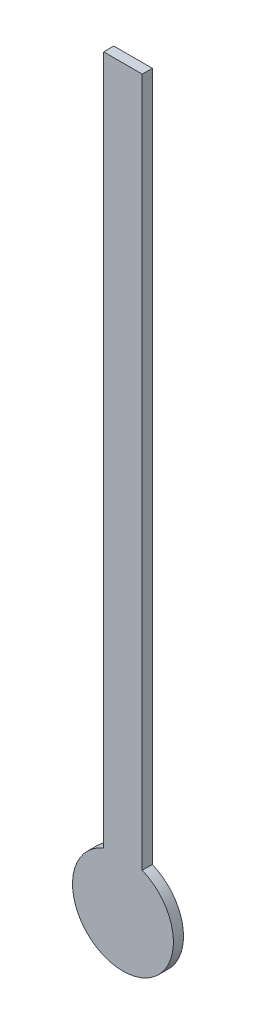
ISO-10303-21;
HEADER;
FILE_DESCRIPTION(('STEP AP214'),'2;1');
FILE_NAME('part.step','',(''),(''),'','','');
FILE_SCHEMA(('AUTOMOTIVE_DESIGN { 1 0 10303 214 1 1 1 1 }'));
ENDSEC;
DATA;
#1=APPLICATION_CONTEXT('core data for automotive mechanical design processes');
#2=APPLICATION_PROTOCOL_DEFINITION('international standard','automotive_design',2000,#1);
#3=PRODUCT_CONTEXT('',#1,'mechanical');
#4=PRODUCT('Part','Part','',(#3));
#5=PRODUCT_RELATED_PRODUCT_CATEGORY('part','',(#4));
#6=PRODUCT_DEFINITION_FORMATION('','',#4);
#7=PRODUCT_DEFINITION_CONTEXT('part definition',#1,'design');
#8=PRODUCT_DEFINITION('design','',#6,#7);
#9=PRODUCT_DEFINITION_SHAPE('','',#8);
#10=(LENGTH_UNIT() NAMED_UNIT(*) SI_UNIT(.MILLI.,.METRE.));
#11=(NAMED_UNIT(*) PLANE_ANGLE_UNIT() SI_UNIT($,.RADIAN.));
#12=(NAMED_UNIT(*) SI_UNIT($,.STERADIAN.) SOLID_ANGLE_UNIT());
#13=UNCERTAINTY_MEASURE_WITH_UNIT(LENGTH_MEASURE(1.E-05),#10,'distance_accuracy_value','');
#14=(GEOMETRIC_REPRESENTATION_CONTEXT(3) GLOBAL_UNCERTAINTY_ASSIGNED_CONTEXT((#13)) GLOBAL_UNIT_ASSIGNED_CONTEXT((#10,
#11,#12)) REPRESENTATION_CONTEXT('',''));
#15=CARTESIAN_POINT('',(0.,0.,0.));
#16=DIRECTION('',(0.,0.,1.));
#17=DIRECTION('',(1.,0.,0.));
#18=AXIS2_PLACEMENT_3D('',#15,#16,#17);
#19=CARTESIAN_POINT('',(1.91230976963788,4.61985620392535,1.));
#20=DIRECTION('',(-1.,0.,0.));
#21=DIRECTION('',(0.,0.,1.));
#22=AXIS2_PLACEMENT_3D('',#19,#20,#21);
#23=PLANE('',#22);
#24=DIRECTION('',(0.,1.,0.));
#25=VECTOR('',#24,1.);
#26=CARTESIAN_POINT('',(1.91230976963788,4.61985620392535,0.));
#27=LINE('',#26,#25);
#28=CARTESIAN_POINT('',(1.91230976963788,4.61985620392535,0.));
#29=VERTEX_POINT('',#28);
#30=CARTESIAN_POINT('',(1.91230976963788,72.9845522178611,0.));
#31=VERTEX_POINT('',#30);
#32=EDGE_CURVE('E97',#29,#31,#27,.T.);
#33=ORIENTED_EDGE('',*,*,#32,.T.);
#34=DIRECTION('',(0.,0.,-1.));
#35=VECTOR('',#34,1.);
#36=CARTESIAN_POINT('',(1.91230976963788,72.9845522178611,1.));
#37=LINE('',#36,#35);
#38=CARTESIAN_POINT('',(1.91230976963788,72.9845522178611,1.));
#39=VERTEX_POINT('',#38);
#40=EDGE_CURVE('E11',#39,#31,#37,.T.);
#41=ORIENTED_EDGE('',*,*,#40,.F.);
#42=DIRECTION('',(0.,1.,0.));
#43=VECTOR('',#42,1.);
#44=CARTESIAN_POINT('',(1.91230976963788,4.61985620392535,1.));
#45=LINE('',#44,#43);
#46=CARTESIAN_POINT('',(1.91230976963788,4.61985620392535,1.));
#47=VERTEX_POINT('',#46);
#48=EDGE_CURVE('E85',#47,#39,#45,.T.);
#49=ORIENTED_EDGE('',*,*,#48,.F.);
#50=DIRECTION('',(0.,0.,-1.));
#51=VECTOR('',#50,1.);
#52=CARTESIAN_POINT('',(1.91230976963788,4.61985620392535,1.));
#53=LINE('',#52,#51);
#54=EDGE_CURVE('E93',#47,#29,#53,.T.);
#55=ORIENTED_EDGE('',*,*,#54,.T.);
#56=EDGE_LOOP('',(#33,#41,#49,#55));
#57=FACE_BOUND('',#56,.T.);
#58=ADVANCED_FACE('F34',(#57),#23,.F.);
#59=CARTESIAN_POINT('',(-1.91230976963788,72.9845522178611,1.));
#60=DIRECTION('',(0.,-1.,0.));
#61=DIRECTION('',(0.,0.,-1.));
#62=AXIS2_PLACEMENT_3D('',#59,#60,#61);
#63=PLANE('',#62);
#64=DIRECTION('',(-1.,0.,0.));
#65=VECTOR('',#64,1.);
#66=CARTESIAN_POINT('',(-1.91230976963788,72.9845522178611,0.));
#67=LINE('',#66,#65);
#68=CARTESIAN_POINT('',(-1.91230976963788,72.9845522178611,0.));
#69=VERTEX_POINT('',#68);
#70=EDGE_CURVE('E89',#31,#69,#67,.T.);
#71=ORIENTED_EDGE('',*,*,#70,.T.);
#72=DIRECTION('',(0.,0.,-1.));
#73=VECTOR('',#72,1.);
#74=CARTESIAN_POINT('',(-1.91230976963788,72.9845522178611,1.));
#75=LINE('',#74,#73);
#76=CARTESIAN_POINT('',(-1.91230976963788,72.9845522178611,1.));
#77=VERTEX_POINT('',#76);
#78=EDGE_CURVE('E42',#77,#69,#75,.T.);
#79=ORIENTED_EDGE('',*,*,#78,.F.);
#80=DIRECTION('',(-1.,0.,0.));
#81=VECTOR('',#80,1.);
#82=CARTESIAN_POINT('',(-1.91230976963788,72.9845522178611,1.));
#83=LINE('',#82,#81);
#84=EDGE_CURVE('E80',#39,#77,#83,.T.);
#85=ORIENTED_EDGE('',*,*,#84,.F.);
#86=ORIENTED_EDGE('',*,*,#40,.T.);
#87=EDGE_LOOP('',(#71,#79,#85,#86));
#88=FACE_BOUND('',#87,.T.);
#89=ADVANCED_FACE('F88',(#88),#63,.F.);
#90=CARTESIAN_POINT('',(-1.91230976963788,4.61985620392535,1.));
#91=DIRECTION('',(1.,0.,0.));
#92=DIRECTION('',(0.,0.,-1.));
#93=AXIS2_PLACEMENT_3D('',#90,#91,#92);
#94=PLANE('',#93);
#95=DIRECTION('',(0.,-1.,0.));
#96=VECTOR('',#95,1.);
#97=CARTESIAN_POINT('',(-1.91230976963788,4.61985620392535,0.));
#98=LINE('',#97,#96);
#99=CARTESIAN_POINT('',(-1.91230976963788,4.61985620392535,0.));
#100=VERTEX_POINT('',#99);
#101=EDGE_CURVE('E67',#69,#100,#98,.T.);
#102=ORIENTED_EDGE('',*,*,#101,.T.);
#103=DIRECTION('',(0.,0.,-1.));
#104=VECTOR('',#103,1.);
#105=CARTESIAN_POINT('',(-1.91230976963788,4.61985620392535,1.));
#106=LINE('',#105,#104);
#107=CARTESIAN_POINT('',(-1.91230976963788,4.61985620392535,1.));
#108=VERTEX_POINT('',#107);
#109=EDGE_CURVE('E90',#108,#100,#106,.T.);
#110=ORIENTED_EDGE('',*,*,#109,.F.);
#111=DIRECTION('',(0.,-1.,0.));
#112=VECTOR('',#111,1.);
#113=CARTESIAN_POINT('',(-1.91230976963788,4.61985620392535,1.));
#114=LINE('',#113,#112);
#115=EDGE_CURVE('E83',#77,#108,#114,.T.);
#116=ORIENTED_EDGE('',*,*,#115,.F.);
#117=ORIENTED_EDGE('',*,*,#78,.T.);
#118=EDGE_LOOP('',(#102,#110,#116,#117));
#119=FACE_BOUND('',#118,.T.);
#120=ADVANCED_FACE('F91',(#119),#94,.F.);
#121=CARTESIAN_POINT('',(0.,0.,1.));
#122=DIRECTION('',(0.,0.,-1.));
#123=DIRECTION('',(-1.,0.,0.));
#124=AXIS2_PLACEMENT_3D('',#121,#122,#123);
#125=CYLINDRICAL_SURFACE('',#124,5.);
#126=CARTESIAN_POINT('',(0.,0.,0.));
#127=DIRECTION('',(0.,0.,1.));
#128=DIRECTION('',(1.,0.,0.));
#129=AXIS2_PLACEMENT_3D('',#126,#127,#128);
#130=CIRCLE('',#129,5.);
#131=EDGE_CURVE('E73',#100,#29,#130,.T.);
#132=ORIENTED_EDGE('',*,*,#131,.T.);
#133=ORIENTED_EDGE('',*,*,#54,.F.);
#134=CARTESIAN_POINT('',(0.,0.,1.));
#135=DIRECTION('',(0.,0.,1.));
#136=DIRECTION('',(1.,0.,0.));
#137=AXIS2_PLACEMENT_3D('',#134,#135,#136);
#138=CIRCLE('',#137,5.);
#139=EDGE_CURVE('E50',#108,#47,#138,.T.);
#140=ORIENTED_EDGE('',*,*,#139,.F.);
#141=ORIENTED_EDGE('',*,*,#109,.T.);
#142=EDGE_LOOP('',(#132,#133,#140,#141));
#143=FACE_BOUND('',#142,.T.);
#144=ADVANCED_FACE('F104',(#143),#125,.T.);
#145=CARTESIAN_POINT('',(0.,0.,1.));
#146=DIRECTION('',(0.,0.,1.));
#147=DIRECTION('',(1.,0.,0.));
#148=AXIS2_PLACEMENT_3D('',#145,#146,#147);
#149=PLANE('',#148);
#150=ORIENTED_EDGE('',*,*,#48,.T.);
#151=ORIENTED_EDGE('',*,*,#84,.T.);
#152=ORIENTED_EDGE('',*,*,#115,.T.);
#153=ORIENTED_EDGE('',*,*,#139,.T.);
#154=EDGE_LOOP('',(#150,#151,#152,#153));
#155=FACE_BOUND('',#154,.T.);
#156=ADVANCED_FACE('F81',(#155),#149,.T.);
#157=CARTESIAN_POINT('',(0.,0.,0.));
#158=DIRECTION('',(0.,0.,1.));
#159=DIRECTION('',(1.,0.,0.));
#160=AXIS2_PLACEMENT_3D('',#157,#158,#159);
#161=PLANE('',#160);
#162=ORIENTED_EDGE('',*,*,#32,.F.);
#163=ORIENTED_EDGE('',*,*,#131,.F.);
#164=ORIENTED_EDGE('',*,*,#101,.F.);
#165=ORIENTED_EDGE('',*,*,#70,.F.);
#166=EDGE_LOOP('',(#162,#163,#164,#165));
#167=FACE_BOUND('',#166,.T.);
#168=ADVANCED_FACE('F107',(#167),#161,.F.);
#169=CLOSED_SHELL('',(#58,#89,#120,#144,#156,#168));
#170=MANIFOLD_SOLID_BREP('B2',#169);
#171=ADVANCED_BREP_SHAPE_REPRESENTATION('',(#18,#170),#14);
#172=SHAPE_DEFINITION_REPRESENTATION(#9,#171);
ENDSEC;
END-ISO-10303-21;
